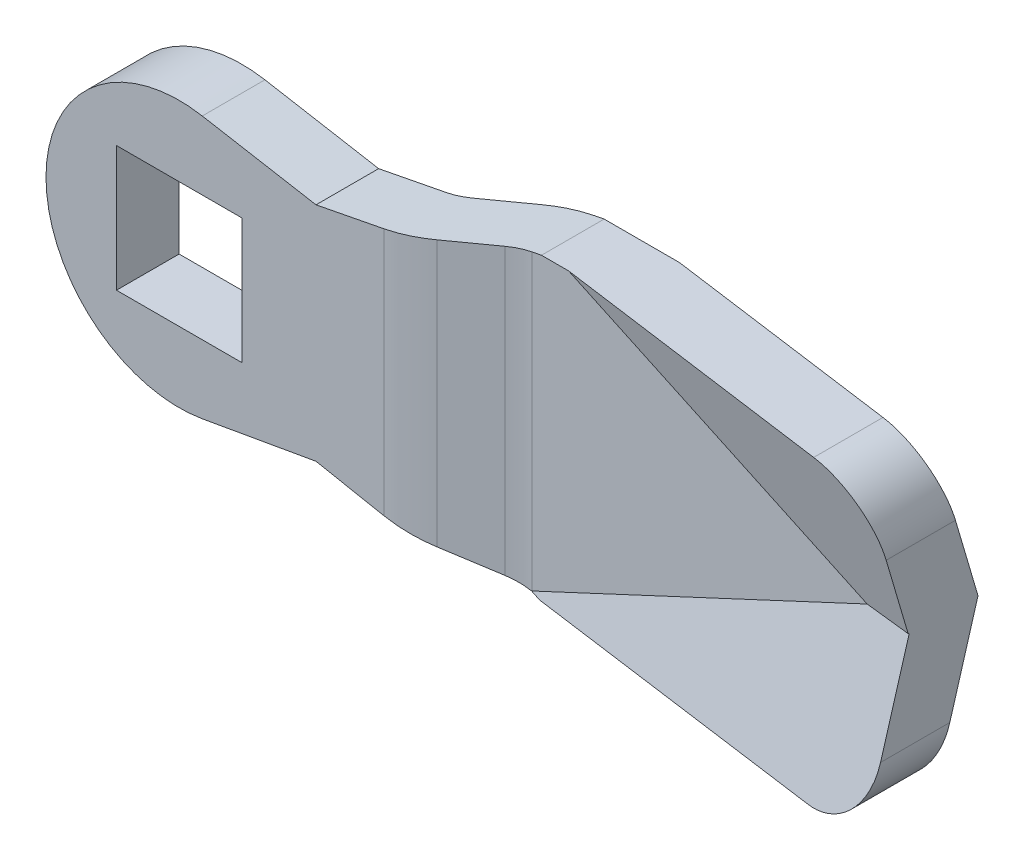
ISO-10303-21;
HEADER;
FILE_DESCRIPTION(('STEP AP214'),'2;1');
FILE_NAME('part.step','',(''),(''),'','','');
FILE_SCHEMA(('AUTOMOTIVE_DESIGN { 1 0 10303 214 1 1 1 1 }'));
ENDSEC;
DATA;
#1=APPLICATION_CONTEXT('core data for automotive mechanical design processes');
#2=APPLICATION_PROTOCOL_DEFINITION('international standard','automotive_design',2000,#1);
#3=PRODUCT_CONTEXT('',#1,'mechanical');
#4=PRODUCT('Part','Part','',(#3));
#5=PRODUCT_RELATED_PRODUCT_CATEGORY('part','',(#4));
#6=PRODUCT_DEFINITION_FORMATION('','',#4);
#7=PRODUCT_DEFINITION_CONTEXT('part definition',#1,'design');
#8=PRODUCT_DEFINITION('design','',#6,#7);
#9=PRODUCT_DEFINITION_SHAPE('','',#8);
#10=(LENGTH_UNIT() NAMED_UNIT(*) SI_UNIT(.MILLI.,.METRE.));
#11=(NAMED_UNIT(*) PLANE_ANGLE_UNIT() SI_UNIT($,.RADIAN.));
#12=(NAMED_UNIT(*) SI_UNIT($,.STERADIAN.) SOLID_ANGLE_UNIT());
#13=UNCERTAINTY_MEASURE_WITH_UNIT(LENGTH_MEASURE(1.E-05),#10,'distance_accuracy_value','');
#14=(GEOMETRIC_REPRESENTATION_CONTEXT(3) GLOBAL_UNCERTAINTY_ASSIGNED_CONTEXT((#13)) GLOBAL_UNIT_ASSIGNED_CONTEXT((#10,
#11,#12)) REPRESENTATION_CONTEXT('',''));
#15=CARTESIAN_POINT('',(0.,0.,0.));
#16=DIRECTION('',(0.,0.,1.));
#17=DIRECTION('',(1.,0.,0.));
#18=AXIS2_PLACEMENT_3D('',#15,#16,#17);
#19=CARTESIAN_POINT('',(45.,30.,38.));
#20=DIRECTION('',(1.,0.,0.));
#21=DIRECTION('',(0.,-1.,0.));
#22=AXIS2_PLACEMENT_3D('',#19,#20,#21);
#23=PLANE('',#22);
#24=DIRECTION('',(0.,0.,1.));
#25=VECTOR('',#24,1.);
#26=CARTESIAN_POINT('',(45.,5.5,38.));
#27=LINE('',#26,#25);
#28=CARTESIAN_POINT('',(45.,5.5,-0.560637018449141));
#29=VERTEX_POINT('',#28);
#30=CARTESIAN_POINT('',(45.,5.5,3.8616542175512));
#31=VERTEX_POINT('',#30);
#32=EDGE_CURVE('E236',#29,#31,#27,.T.);
#33=ORIENTED_EDGE('',*,*,#32,.T.);
#34=DIRECTION('',(0.,-0.959272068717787,-0.282483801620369));
#35=VECTOR('',#34,1.);
#36=CARTESIAN_POINT('',(45.,37.2957397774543,13.2247762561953));
#37=LINE('',#36,#35);
#38=CARTESIAN_POINT('',(45.,0.743954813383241,2.46110710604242));
#39=VERTEX_POINT('',#38);
#40=EDGE_CURVE('E222',#31,#39,#37,.T.);
#41=ORIENTED_EDGE('',*,*,#40,.T.);
#42=DIRECTION('',(0.,0.28233036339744,0.959317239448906));
#43=VECTOR('',#42,1.);
#44=CARTESIAN_POINT('',(45.,12.7014764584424,43.091014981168));
#45=LINE('',#44,#43);
#46=CARTESIAN_POINT('',(45.,0.722929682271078,2.38966678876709));
#47=VERTEX_POINT('',#46);
#48=EDGE_CURVE('E22',#47,#39,#45,.T.);
#49=ORIENTED_EDGE('',*,*,#48,.F.);
#50=DIRECTION('',(0.,-0.959272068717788,0.282483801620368));
#51=VECTOR('',#50,1.);
#52=CARTESIAN_POINT('',(45.,18.0141286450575,-2.7021979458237));
#53=LINE('',#52,#51);
#54=CARTESIAN_POINT('',(45.,-5.5,4.22217801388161));
#55=VERTEX_POINT('',#54);
#56=EDGE_CURVE('E612',#47,#55,#53,.T.);
#57=ORIENTED_EDGE('',*,*,#56,.T.);
#58=DIRECTION('',(0.,0.,1.));
#59=VECTOR('',#58,1.);
#60=CARTESIAN_POINT('',(45.,-5.5,38.));
#61=LINE('',#60,#59);
#62=CARTESIAN_POINT('',(45.,-5.5,-0.200113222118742));
#63=VERTEX_POINT('',#62);
#64=EDGE_CURVE('E249',#55,#63,#61,.F.);
#65=ORIENTED_EDGE('',*,*,#64,.T.);
#66=DIRECTION('',(0.,0.959272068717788,-0.282483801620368));
#67=VECTOR('',#66,1.);
#68=CARTESIAN_POINT('',(45.,-65.6919628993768,17.5250505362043));
#69=LINE('',#68,#67);
#70=CARTESIAN_POINT('',(45.,0.612142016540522,-2.));
#71=VERTEX_POINT('',#70);
#72=EDGE_CURVE('E373',#63,#71,#69,.T.);
#73=ORIENTED_EDGE('',*,*,#72,.T.);
#74=DIRECTION('',(0.,0.959272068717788,0.28248380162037));
#75=VECTOR('',#74,1.);
#76=CARTESIAN_POINT('',(45.,48.8419656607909,12.2025858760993));
#77=LINE('',#76,#75);
#78=EDGE_CURVE('E379',#71,#29,#77,.T.);
#79=ORIENTED_EDGE('',*,*,#78,.T.);
#80=EDGE_LOOP('',(#33,#41,#49,#57,#65,#73,#79));
#81=FACE_BOUND('',#80,.T.);
#82=ADVANCED_FACE('F14',(#81),#23,.T.);
#83=CARTESIAN_POINT('',(41.,5.5,38.));
#84=DIRECTION('',(0.,0.,-1.));
#85=DIRECTION('',(0.,-1.,0.));
#86=AXIS2_PLACEMENT_3D('',#83,#84,#85);
#87=CYLINDRICAL_SURFACE('',#86,4.);
#88=CARTESIAN_POINT('',(41.,5.5,3.31238622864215));
#89=DIRECTION('',(0.130596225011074,0.280064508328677,-0.951056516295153));
#90=DIRECTION('',(-0.401933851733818,-0.861949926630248,-0.309016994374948));
#91=AXIS2_PLACEMENT_3D('',#88,#89,#90);
#92=ELLIPSE('',#91,4.20584889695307,4.);
#93=CARTESIAN_POINT('',(41.,9.5,4.49029523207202));
#94=VERTEX_POINT('',#93);
#95=EDGE_CURVE('E245',#31,#94,#92,.F.);
#96=ORIENTED_EDGE('',*,*,#95,.F.);
#97=ORIENTED_EDGE('',*,*,#32,.F.);
#98=CARTESIAN_POINT('',(41.,5.5,-1.1099050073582));
#99=DIRECTION('',(-0.130596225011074,-0.280064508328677,0.951056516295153));
#100=DIRECTION('',(-0.401933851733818,-0.861949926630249,-0.309016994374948));
#101=AXIS2_PLACEMENT_3D('',#98,#99,#100);
#102=ELLIPSE('',#101,4.20584889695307,4.);
#103=CARTESIAN_POINT('',(41.,9.5,0.0680039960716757));
#104=VERTEX_POINT('',#103);
#105=EDGE_CURVE('E240',#104,#29,#102,.F.);
#106=ORIENTED_EDGE('',*,*,#105,.F.);
#107=DIRECTION('',(0.,0.,1.));
#108=VECTOR('',#107,1.);
#109=CARTESIAN_POINT('',(41.,9.5,38.));
#110=LINE('',#109,#108);
#111=EDGE_CURVE('E241',#94,#104,#110,.F.);
#112=ORIENTED_EDGE('',*,*,#111,.F.);
#113=EDGE_LOOP('',(#96,#97,#106,#112));
#114=FACE_BOUND('',#113,.T.);
#115=ADVANCED_FACE('F306',(#114),#87,.T.);
#116=CARTESIAN_POINT('',(41.5329093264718,1.45233554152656,4.85316954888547));
#117=DIRECTION('',(0.0012142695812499,0.959316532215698,-0.282330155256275));
#118=DIRECTION('',(0.,-0.28233036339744,-0.959317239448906));
#119=AXIS2_PLACEMENT_3D('',#116,#117,#118);
#120=PLANE('',#119);
#121=DIRECTION('',(0.988057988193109,0.0423498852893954,0.148148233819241));
#122=VECTOR('',#121,1.);
#123=CARTESIAN_POINT('',(41.9950123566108,0.615155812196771,2.01054285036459));
#124=LINE('',#123,#122);
#125=CARTESIAN_POINT('',(41.9246980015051,0.612142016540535,2.));
#126=VERTEX_POINT('',#125);
#127=EDGE_CURVE('E9',#126,#39,#124,.T.);
#128=ORIENTED_EDGE('',*,*,#127,.F.);
#129=DIRECTION('',(0.991434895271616,0.0357164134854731,0.125623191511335));
#130=VECTOR('',#129,1.);
#131=CARTESIAN_POINT('',(41.9246980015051,0.612142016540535,2.));
#132=LINE('',#131,#130);
#133=EDGE_CURVE('E237',#126,#47,#132,.T.);
#134=ORIENTED_EDGE('',*,*,#133,.T.);
#135=ORIENTED_EDGE('',*,*,#48,.T.);
#136=EDGE_LOOP('',(#128,#134,#135));
#137=FACE_BOUND('',#136,.T.);
#138=ADVANCED_FACE('F239',(#137),#120,.F.);
#139=CARTESIAN_POINT('',(41.,-5.5,6.));
#140=DIRECTION('',(0.,0.,1.));
#141=DIRECTION('',(0.,1.,0.));
#142=AXIS2_PLACEMENT_3D('',#139,#140,#141);
#143=CYLINDRICAL_SURFACE('',#142,4.);
#144=ORIENTED_EDGE('',*,*,#64,.F.);
#145=CARTESIAN_POINT('',(41.,-5.5,3.67291002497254));
#146=DIRECTION('',(0.130596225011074,-0.280064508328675,-0.951056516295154));
#147=DIRECTION('',(0.401933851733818,-0.861949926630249,0.309016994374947));
#148=AXIS2_PLACEMENT_3D('',#145,#146,#147);
#149=ELLIPSE('',#148,4.20584889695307,4.);
#150=CARTESIAN_POINT('',(41.,-9.5,4.85081902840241));
#151=VERTEX_POINT('',#150);
#152=EDGE_CURVE('E252',#151,#55,#149,.F.);
#153=ORIENTED_EDGE('',*,*,#152,.F.);
#154=DIRECTION('',(0.,0.,1.));
#155=VECTOR('',#154,1.);
#156=CARTESIAN_POINT('',(41.,-9.5,6.));
#157=LINE('',#156,#155);
#158=CARTESIAN_POINT('',(41.,-9.5,0.428527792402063));
#159=VERTEX_POINT('',#158);
#160=EDGE_CURVE('E254',#159,#151,#157,.T.);
#161=ORIENTED_EDGE('',*,*,#160,.F.);
#162=CARTESIAN_POINT('',(41.,-5.5,-0.749381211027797));
#163=DIRECTION('',(-0.130596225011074,0.280064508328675,0.951056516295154));
#164=DIRECTION('',(0.401933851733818,-0.861949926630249,0.309016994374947));
#165=AXIS2_PLACEMENT_3D('',#162,#163,#164);
#166=ELLIPSE('',#165,4.20584889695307,4.);
#167=EDGE_CURVE('E247',#63,#159,#166,.F.);
#168=ORIENTED_EDGE('',*,*,#167,.F.);
#169=EDGE_LOOP('',(#144,#153,#161,#168));
#170=FACE_BOUND('',#169,.T.);
#171=ADVANCED_FACE('F385',(#170),#143,.T.);
#172=CARTESIAN_POINT('',(6.5,2.8,-2.4));
#173=DIRECTION('',(0.,-1.,0.));
#174=DIRECTION('',(-1.,0.,0.));
#175=AXIS2_PLACEMENT_3D('',#172,#173,#174);
#176=PLANE('',#175);
#177=DIRECTION('',(0.707106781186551,0.,0.707106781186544));
#178=VECTOR('',#177,1.);
#179=CARTESIAN_POINT('',(7.5,2.8,-3.4));
#180=LINE('',#179,#178);
#181=CARTESIAN_POINT('',(8.5,2.8,-2.4));
#182=VERTEX_POINT('',#181);
#183=CARTESIAN_POINT('',(10.5,2.8,-0.400000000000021));
#184=VERTEX_POINT('',#183);
#185=EDGE_CURVE('E605',#182,#184,#180,.T.);
#186=ORIENTED_EDGE('',*,*,#185,.F.);
#187=DIRECTION('',(1.,0.,0.));
#188=VECTOR('',#187,1.);
#189=CARTESIAN_POINT('',(6.5,2.8,-2.4));
#190=LINE('',#189,#188);
#191=CARTESIAN_POINT('',(6.5,2.8,-2.4));
#192=VERTEX_POINT('',#191);
#193=EDGE_CURVE('E589',#192,#182,#190,.T.);
#194=ORIENTED_EDGE('',*,*,#193,.F.);
#195=DIRECTION('',(0.,0.,1.));
#196=VECTOR('',#195,1.);
#197=CARTESIAN_POINT('',(6.5,2.8,-2.4));
#198=LINE('',#197,#196);
#199=CARTESIAN_POINT('',(6.5,2.8,0.));
#200=VERTEX_POINT('',#199);
#201=EDGE_CURVE('E580',#192,#200,#198,.T.);
#202=ORIENTED_EDGE('',*,*,#201,.T.);
#203=DIRECTION('',(1.,0.,0.));
#204=VECTOR('',#203,1.);
#205=CARTESIAN_POINT('',(6.5,2.8,0.));
#206=LINE('',#205,#204);
#207=CARTESIAN_POINT('',(10.5,2.8,0.));
#208=VERTEX_POINT('',#207);
#209=EDGE_CURVE('E37',#200,#208,#206,.T.);
#210=ORIENTED_EDGE('',*,*,#209,.T.);
#211=DIRECTION('',(0.,0.,1.));
#212=VECTOR('',#211,1.);
#213=CARTESIAN_POINT('',(10.5,2.8,-2.4));
#214=LINE('',#213,#212);
#215=EDGE_CURVE('E582',#184,#208,#214,.T.);
#216=ORIENTED_EDGE('',*,*,#215,.F.);
#217=EDGE_LOOP('',(#186,#194,#202,#210,#216));
#218=FACE_BOUND('',#217,.T.);
#219=ADVANCED_FACE('F648',(#218),#176,.F.);
#220=CARTESIAN_POINT('',(10.5,-2.8,-2.4));
#221=DIRECTION('',(1.,0.,0.));
#222=DIRECTION('',(0.,-1.,0.));
#223=AXIS2_PLACEMENT_3D('',#220,#221,#222);
#224=PLANE('',#223);
#225=DIRECTION('',(0.,0.,1.));
#226=VECTOR('',#225,1.);
#227=CARTESIAN_POINT('',(10.5,-2.8,-2.4));
#228=LINE('',#227,#226);
#229=CARTESIAN_POINT('',(10.5,-2.8,-0.400000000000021));
#230=VERTEX_POINT('',#229);
#231=CARTESIAN_POINT('',(10.5,-2.8,0.));
#232=VERTEX_POINT('',#231);
#233=EDGE_CURVE('E584',#230,#232,#228,.T.);
#234=ORIENTED_EDGE('',*,*,#233,.F.);
#235=DIRECTION('',(0.,-1.,0.));
#236=VECTOR('',#235,1.);
#237=CARTESIAN_POINT('',(10.5,9.5,-0.400000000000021));
#238=LINE('',#237,#236);
#239=EDGE_CURVE('E609',#184,#230,#238,.T.);
#240=ORIENTED_EDGE('',*,*,#239,.F.);
#241=ORIENTED_EDGE('',*,*,#215,.T.);
#242=DIRECTION('',(0.,1.,0.));
#243=VECTOR('',#242,1.);
#244=CARTESIAN_POINT('',(10.5,-2.8,0.));
#245=LINE('',#244,#243);
#246=EDGE_CURVE('E598',#232,#208,#245,.T.);
#247=ORIENTED_EDGE('',*,*,#246,.F.);
#248=EDGE_LOOP('',(#234,#240,#241,#247));
#249=FACE_BOUND('',#248,.T.);
#250=ADVANCED_FACE('F654',(#249),#224,.T.);
#251=CARTESIAN_POINT('',(10.5,-2.8,-2.4));
#252=DIRECTION('',(0.,1.,0.));
#253=DIRECTION('',(1.,0.,0.));
#254=AXIS2_PLACEMENT_3D('',#251,#252,#253);
#255=PLANE('',#254);
#256=DIRECTION('',(0.707106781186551,0.,0.707106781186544));
#257=VECTOR('',#256,1.);
#258=CARTESIAN_POINT('',(8.5,-2.8,-2.4));
#259=LINE('',#258,#257);
#260=CARTESIAN_POINT('',(8.5,-2.8,-2.4));
#261=VERTEX_POINT('',#260);
#262=EDGE_CURVE('E29',#261,#230,#259,.T.);
#263=ORIENTED_EDGE('',*,*,#262,.T.);
#264=ORIENTED_EDGE('',*,*,#233,.T.);
#265=DIRECTION('',(-1.,0.,0.));
#266=VECTOR('',#265,1.);
#267=CARTESIAN_POINT('',(10.5,-2.8,0.));
#268=LINE('',#267,#266);
#269=CARTESIAN_POINT('',(6.5,-2.8,0.));
#270=VERTEX_POINT('',#269);
#271=EDGE_CURVE('E600',#232,#270,#268,.T.);
#272=ORIENTED_EDGE('',*,*,#271,.T.);
#273=DIRECTION('',(0.,0.,1.));
#274=VECTOR('',#273,1.);
#275=CARTESIAN_POINT('',(6.5,-2.8,-2.4));
#276=LINE('',#275,#274);
#277=CARTESIAN_POINT('',(6.5,-2.8,-2.4));
#278=VERTEX_POINT('',#277);
#279=EDGE_CURVE('E586',#278,#270,#276,.T.);
#280=ORIENTED_EDGE('',*,*,#279,.F.);
#281=DIRECTION('',(-1.,0.,0.));
#282=VECTOR('',#281,1.);
#283=CARTESIAN_POINT('',(10.5,-2.8,-2.4));
#284=LINE('',#283,#282);
#285=EDGE_CURVE('E592',#261,#278,#284,.T.);
#286=ORIENTED_EDGE('',*,*,#285,.F.);
#287=EDGE_LOOP('',(#263,#264,#272,#280,#286));
#288=FACE_BOUND('',#287,.T.);
#289=ADVANCED_FACE('F658',(#288),#255,.F.);
#290=CARTESIAN_POINT('',(6.5,-2.8,-2.4));
#291=DIRECTION('',(0.,0.,-1.));
#292=DIRECTION('',(0.,-1.,0.));
#293=AXIS2_PLACEMENT_3D('',#290,#291,#292);
#294=PLANE('',#293);
#295=ORIENTED_EDGE('',*,*,#193,.T.);
#296=DIRECTION('',(0.,-1.,0.));
#297=VECTOR('',#296,1.);
#298=CARTESIAN_POINT('',(8.5,9.5,-2.4));
#299=LINE('',#298,#297);
#300=EDGE_CURVE('E607',#182,#261,#299,.T.);
#301=ORIENTED_EDGE('',*,*,#300,.T.);
#302=ORIENTED_EDGE('',*,*,#285,.T.);
#303=DIRECTION('',(0.,-1.,0.));
#304=VECTOR('',#303,1.);
#305=CARTESIAN_POINT('',(6.5,2.8,-2.4));
#306=LINE('',#305,#304);
#307=EDGE_CURVE('E594',#192,#278,#306,.T.);
#308=ORIENTED_EDGE('',*,*,#307,.F.);
#309=EDGE_LOOP('',(#295,#301,#302,#308));
#310=FACE_BOUND('',#309,.T.);
#311=ADVANCED_FACE('F346',(#310),#294,.T.);
#312=CARTESIAN_POINT('',(0.,-9.5,4.));
#313=DIRECTION('',(0.,0.,-1.));
#314=DIRECTION('',(0.,-1.,0.));
#315=AXIS2_PLACEMENT_3D('',#312,#313,#314);
#316=PLANE('',#315);
#317=DIRECTION('',(0.,-1.,0.));
#318=VECTOR('',#317,1.);
#319=CARTESIAN_POINT('',(-4.,-9.5,4.));
#320=LINE('',#319,#318);
#321=CARTESIAN_POINT('',(-4.,4.,4.));
#322=VERTEX_POINT('',#321);
#323=CARTESIAN_POINT('',(-4.,-4.,4.));
#324=VERTEX_POINT('',#323);
#325=EDGE_CURVE('E380',#322,#324,#320,.T.);
#326=ORIENTED_EDGE('',*,*,#325,.F.);
#327=DIRECTION('',(1.,0.,0.));
#328=VECTOR('',#327,1.);
#329=CARTESIAN_POINT('',(0.,4.,4.));
#330=LINE('',#329,#328);
#331=CARTESIAN_POINT('',(4.,4.,4.));
#332=VERTEX_POINT('',#331);
#333=EDGE_CURVE('E502',#322,#332,#330,.T.);
#334=ORIENTED_EDGE('',*,*,#333,.T.);
#335=DIRECTION('',(0.,1.,0.));
#336=VECTOR('',#335,1.);
#337=CARTESIAN_POINT('',(4.,-9.5,4.));
#338=LINE('',#337,#336);
#339=CARTESIAN_POINT('',(4.,-4.,4.));
#340=VERTEX_POINT('',#339);
#341=EDGE_CURVE('E505',#340,#332,#338,.T.);
#342=ORIENTED_EDGE('',*,*,#341,.F.);
#343=DIRECTION('',(-1.,0.,0.));
#344=VECTOR('',#343,1.);
#345=CARTESIAN_POINT('',(0.,-4.,4.));
#346=LINE('',#345,#344);
#347=EDGE_CURVE('E508',#340,#324,#346,.T.);
#348=ORIENTED_EDGE('',*,*,#347,.T.);
#349=EDGE_LOOP('',(#326,#334,#342,#348));
#350=FACE_BOUND('',#349,.T.);
#351=DIRECTION('',(0.981627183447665,0.190808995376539,0.));
#352=VECTOR('',#351,1.);
#353=CARTESIAN_POINT('',(-2.78934915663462,4.8499574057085,4.));
#354=LINE('',#353,#352);
#355=CARTESIAN_POINT('',(8.73728230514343,7.09050759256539,4.));
#356=VERTEX_POINT('',#355);
#357=CARTESIAN_POINT('',(13.0786438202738,7.934382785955,4.));
#358=VERTEX_POINT('',#357);
#359=EDGE_CURVE('E461',#356,#358,#354,.T.);
#360=ORIENTED_EDGE('',*,*,#359,.F.);
#361=DIRECTION('',(-0.984807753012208,0.17364817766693,0.));
#362=VECTOR('',#361,1.);
#363=CARTESIAN_POINT('',(3.10060519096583,8.08440584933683,4.));
#364=LINE('',#363,#362);
#365=CARTESIAN_POINT('',(1.47600951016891,8.37086590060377,4.));
#366=VERTEX_POINT('',#365);
#367=EDGE_CURVE('E476',#356,#366,#364,.T.);
#368=ORIENTED_EDGE('',*,*,#367,.T.);
#369=CARTESIAN_POINT('',(0.,0.,4.));
#370=DIRECTION('',(0.,0.,-1.));
#371=DIRECTION('',(0.,-1.,0.));
#372=AXIS2_PLACEMENT_3D('',#369,#370,#371);
#373=CIRCLE('',#372,8.5);
#374=CARTESIAN_POINT('',(1.47600951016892,-8.37086590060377,4.));
#375=VERTEX_POINT('',#374);
#376=EDGE_CURVE('E474',#375,#366,#373,.T.);
#377=ORIENTED_EDGE('',*,*,#376,.F.);
#378=DIRECTION('',(-0.984807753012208,-0.17364817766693,0.));
#379=VECTOR('',#378,1.);
#380=CARTESIAN_POINT('',(-0.148586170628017,-8.65732595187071,4.));
#381=LINE('',#380,#379);
#382=CARTESIAN_POINT('',(8.73728230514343,-7.0905075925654,4.));
#383=VERTEX_POINT('',#382);
#384=EDGE_CURVE('E479',#383,#375,#381,.T.);
#385=ORIENTED_EDGE('',*,*,#384,.F.);
#386=DIRECTION('',(0.981627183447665,-0.190808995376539,0.));
#387=VECTOR('',#386,1.);
#388=CARTESIAN_POINT('',(0.769413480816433,-5.54171078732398,4.));
#389=LINE('',#388,#387);
#390=CARTESIAN_POINT('',(13.0786438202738,-7.93438278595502,4.));
#391=VERTEX_POINT('',#390);
#392=EDGE_CURVE('E550',#383,#391,#389,.T.);
#393=ORIENTED_EDGE('',*,*,#392,.T.);
#394=DIRECTION('',(0.,1.,0.));
#395=VECTOR('',#394,1.);
#396=CARTESIAN_POINT('',(13.0786438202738,-9.5,4.));
#397=LINE('',#396,#395);
#398=EDGE_CURVE('E441',#391,#358,#397,.T.);
#399=ORIENTED_EDGE('',*,*,#398,.T.);
#400=EDGE_LOOP('',(#360,#368,#377,#385,#393,#399));
#401=FACE_BOUND('',#400,.T.);
#402=ADVANCED_FACE('F343',(#350,#401),#316,.F.);
#403=CARTESIAN_POINT('',(0.,-9.5,0.));
#404=DIRECTION('',(0.,0.,1.));
#405=DIRECTION('',(0.,1.,0.));
#406=AXIS2_PLACEMENT_3D('',#403,#404,#405);
#407=PLANE('',#406);
#408=ORIENTED_EDGE('',*,*,#209,.F.);
#409=DIRECTION('',(0.,-1.,0.));
#410=VECTOR('',#409,1.);
#411=CARTESIAN_POINT('',(6.5,2.8,0.));
#412=LINE('',#411,#410);
#413=EDGE_CURVE('E603',#200,#270,#412,.T.);
#414=ORIENTED_EDGE('',*,*,#413,.T.);
#415=ORIENTED_EDGE('',*,*,#271,.F.);
#416=ORIENTED_EDGE('',*,*,#246,.T.);
#417=EDGE_LOOP('',(#408,#414,#415,#416));
#418=FACE_BOUND('',#417,.T.);
#419=DIRECTION('',(0.,-1.,0.));
#420=VECTOR('',#419,1.);
#421=CARTESIAN_POINT('',(-4.,4.,0.));
#422=LINE('',#421,#420);
#423=CARTESIAN_POINT('',(-4.,4.,0.));
#424=VERTEX_POINT('',#423);
#425=CARTESIAN_POINT('',(-4.,-4.,0.));
#426=VERTEX_POINT('',#425);
#427=EDGE_CURVE('E481',#424,#426,#422,.T.);
#428=ORIENTED_EDGE('',*,*,#427,.T.);
#429=DIRECTION('',(-1.,0.,0.));
#430=VECTOR('',#429,1.);
#431=CARTESIAN_POINT('',(4.,-4.,0.));
#432=LINE('',#431,#430);
#433=CARTESIAN_POINT('',(4.,-4.,0.));
#434=VERTEX_POINT('',#433);
#435=EDGE_CURVE('E484',#434,#426,#432,.T.);
#436=ORIENTED_EDGE('',*,*,#435,.F.);
#437=DIRECTION('',(0.,1.,0.));
#438=VECTOR('',#437,1.);
#439=CARTESIAN_POINT('',(4.,-4.,0.));
#440=LINE('',#439,#438);
#441=CARTESIAN_POINT('',(4.,4.,0.));
#442=VERTEX_POINT('',#441);
#443=EDGE_CURVE('E487',#434,#442,#440,.T.);
#444=ORIENTED_EDGE('',*,*,#443,.T.);
#445=DIRECTION('',(1.,0.,0.));
#446=VECTOR('',#445,1.);
#447=CARTESIAN_POINT('',(-4.,4.,0.));
#448=LINE('',#447,#446);
#449=EDGE_CURVE('E490',#424,#442,#448,.T.);
#450=ORIENTED_EDGE('',*,*,#449,.F.);
#451=EDGE_LOOP('',(#428,#436,#444,#450));
#452=FACE_BOUND('',#451,.T.);
#453=DIRECTION('',(0.,1.,0.));
#454=VECTOR('',#453,1.);
#455=CARTESIAN_POINT('',(13.0786438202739,-9.5,0.));
#456=LINE('',#455,#454);
#457=CARTESIAN_POINT('',(13.0786438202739,-7.93438278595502,0.));
#458=VERTEX_POINT('',#457);
#459=CARTESIAN_POINT('',(13.0786438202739,7.93438278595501,0.));
#460=VERTEX_POINT('',#459);
#461=EDGE_CURVE('E438',#458,#460,#456,.T.);
#462=ORIENTED_EDGE('',*,*,#461,.F.);
#463=DIRECTION('',(-0.981627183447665,0.190808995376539,0.));
#464=VECTOR('',#463,1.);
#465=CARTESIAN_POINT('',(0.769413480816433,-5.54171078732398,0.));
#466=LINE('',#465,#464);
#467=CARTESIAN_POINT('',(8.73728230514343,-7.0905075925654,0.));
#468=VERTEX_POINT('',#467);
#469=EDGE_CURVE('E526',#458,#468,#466,.T.);
#470=ORIENTED_EDGE('',*,*,#469,.T.);
#471=DIRECTION('',(0.984807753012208,0.17364817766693,0.));
#472=VECTOR('',#471,1.);
#473=CARTESIAN_POINT('',(-0.148586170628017,-8.65732595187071,0.));
#474=LINE('',#473,#472);
#475=CARTESIAN_POINT('',(1.47600951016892,-8.37086590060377,0.));
#476=VERTEX_POINT('',#475);
#477=EDGE_CURVE('E257',#476,#468,#474,.T.);
#478=ORIENTED_EDGE('',*,*,#477,.F.);
#479=CARTESIAN_POINT('',(0.,0.,0.));
#480=DIRECTION('',(0.,0.,1.));
#481=DIRECTION('',(0.,1.,0.));
#482=AXIS2_PLACEMENT_3D('',#479,#480,#481);
#483=CIRCLE('',#482,8.5);
#484=CARTESIAN_POINT('',(1.47600951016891,8.37086590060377,0.));
#485=VERTEX_POINT('',#484);
#486=EDGE_CURVE('E472',#485,#476,#483,.T.);
#487=ORIENTED_EDGE('',*,*,#486,.F.);
#488=DIRECTION('',(0.984807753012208,-0.17364817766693,0.));
#489=VECTOR('',#488,1.);
#490=CARTESIAN_POINT('',(3.10060519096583,8.08440584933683,0.));
#491=LINE('',#490,#489);
#492=CARTESIAN_POINT('',(8.73728230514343,7.09050759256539,0.));
#493=VERTEX_POINT('',#492);
#494=EDGE_CURVE('E259',#485,#493,#491,.T.);
#495=ORIENTED_EDGE('',*,*,#494,.T.);
#496=DIRECTION('',(-0.981627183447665,-0.190808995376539,0.));
#497=VECTOR('',#496,1.);
#498=CARTESIAN_POINT('',(-2.78934915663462,4.8499574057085,0.));
#499=LINE('',#498,#497);
#500=EDGE_CURVE('E527',#460,#493,#499,.T.);
#501=ORIENTED_EDGE('',*,*,#500,.F.);
#502=EDGE_LOOP('',(#462,#470,#478,#487,#495,#501));
#503=FACE_BOUND('',#502,.T.);
#504=ADVANCED_FACE('F319',(#418,#452,#503),#407,.F.);
#505=CARTESIAN_POINT('',(20.5128904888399,9.5,6.));
#506=DIRECTION('',(0.,-1.,0.));
#507=DIRECTION('',(-1.,0.,0.));
#508=AXIS2_PLACEMENT_3D('',#505,#506,#507);
#509=PLANE('',#508);
#510=DIRECTION('',(0.990703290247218,0.,0.13604040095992));
#511=VECTOR('',#510,1.);
#512=CARTESIAN_POINT('',(46.8525031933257,9.5,5.29394339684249));
#513=LINE('',#512,#511);
#514=CARTESIAN_POINT('',(22.8646250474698,9.5,2.));
#515=VERTEX_POINT('',#514);
#516=EDGE_CURVE('E412',#515,#94,#513,.T.);
#517=ORIENTED_EDGE('',*,*,#516,.T.);
#518=ORIENTED_EDGE('',*,*,#111,.T.);
#519=DIRECTION('',(-0.990703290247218,0.,-0.13604040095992));
#520=VECTOR('',#519,1.);
#521=CARTESIAN_POINT('',(68.6351335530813,9.5,3.86277755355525));
#522=LINE('',#521,#520);
#523=CARTESIAN_POINT('',(25.9399270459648,9.5,-2.));
#524=VERTEX_POINT('',#523);
#525=EDGE_CURVE('E401',#104,#524,#522,.T.);
#526=ORIENTED_EDGE('',*,*,#525,.T.);
#527=DIRECTION('',(-1.,0.,0.));
#528=VECTOR('',#527,1.);
#529=CARTESIAN_POINT('',(45.,9.5,-2.));
#530=LINE('',#529,#528);
#531=CARTESIAN_POINT('',(21.1330461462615,9.5,-2.));
#532=VERTEX_POINT('',#531);
#533=EDGE_CURVE('E395',#524,#532,#530,.T.);
#534=ORIENTED_EDGE('',*,*,#533,.T.);
#535=DIRECTION('',(0.,0.,-1.));
#536=VECTOR('',#535,1.);
#537=CARTESIAN_POINT('',(21.1330461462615,9.5,6.));
#538=LINE('',#537,#536);
#539=CARTESIAN_POINT('',(21.1330461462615,9.5,2.));
#540=VERTEX_POINT('',#539);
#541=EDGE_CURVE('E470',#540,#532,#538,.T.);
#542=ORIENTED_EDGE('',*,*,#541,.F.);
#543=DIRECTION('',(-1.,0.,0.));
#544=VECTOR('',#543,1.);
#545=CARTESIAN_POINT('',(45.,9.5,2.));
#546=LINE('',#545,#544);
#547=EDGE_CURVE('E423',#515,#540,#546,.T.);
#548=ORIENTED_EDGE('',*,*,#547,.F.);
#549=EDGE_LOOP('',(#517,#518,#526,#534,#542,#548));
#550=FACE_BOUND('',#549,.T.);
#551=ADVANCED_FACE('F315',(#550),#509,.F.);
#552=CARTESIAN_POINT('',(20.5128904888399,-9.5,6.));
#553=DIRECTION('',(0.,1.,0.));
#554=DIRECTION('',(1.,0.,0.));
#555=AXIS2_PLACEMENT_3D('',#552,#553,#554);
#556=CYLINDRICAL_SURFACE('',#555,4.);
#557=DIRECTION('',(0.,1.,0.));
#558=VECTOR('',#557,1.);
#559=CARTESIAN_POINT('',(20.5128904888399,-9.5,2.));
#560=LINE('',#559,#558);
#561=CARTESIAN_POINT('',(20.5128904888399,-9.3723478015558,2.));
#562=VERTEX_POINT('',#561);
#563=CARTESIAN_POINT('',(20.5128904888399,9.37945395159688,2.));
#564=VERTEX_POINT('',#563);
#565=EDGE_CURVE('E404',#562,#564,#560,.T.);
#566=ORIENTED_EDGE('',*,*,#565,.T.);
#567=CARTESIAN_POINT('',(20.5128904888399,9.37945395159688,6.));
#568=DIRECTION('',(-0.190808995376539,0.981627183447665,0.));
#569=DIRECTION('',(0.981627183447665,0.190808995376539,0.));
#570=AXIS2_PLACEMENT_3D('',#567,#568,#569);
#571=ELLIPSE('',#570,4.07486677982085,4.);
#572=CARTESIAN_POINT('',(19.0794186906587,9.10081526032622,2.26567829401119));
#573=VERTEX_POINT('',#572);
#574=EDGE_CURVE('E457',#564,#573,#571,.T.);
#575=ORIENTED_EDGE('',*,*,#574,.T.);
#576=DIRECTION('',(0.,1.,0.));
#577=VECTOR('',#576,1.);
#578=CARTESIAN_POINT('',(19.0794186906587,-9.5,2.26567829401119));
#579=LINE('',#578,#577);
#580=CARTESIAN_POINT('',(19.0794186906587,-9.10081526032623,2.26567829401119));
#581=VERTEX_POINT('',#580);
#582=EDGE_CURVE('E428',#581,#573,#579,.T.);
#583=ORIENTED_EDGE('',*,*,#582,.F.);
#584=CARTESIAN_POINT('',(20.5128904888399,-9.37945395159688,6.));
#585=DIRECTION('',(0.190808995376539,0.981627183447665,0.));
#586=DIRECTION('',(-0.981627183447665,0.190808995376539,0.));
#587=AXIS2_PLACEMENT_3D('',#584,#585,#586);
#588=ELLIPSE('',#587,4.07486677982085,4.);
#589=CARTESIAN_POINT('',(20.5021269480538,-9.37736173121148,2.00001448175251));
#590=VERTEX_POINT('',#589);
#591=EDGE_CURVE('E456',#590,#581,#588,.T.);
#592=ORIENTED_EDGE('',*,*,#591,.F.);
#593=CARTESIAN_POINT('',(20.5128904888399,-7.93831092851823,6.));
#594=DIRECTION('',(-0.401933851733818,0.861949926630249,-0.309016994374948));
#595=DIRECTION('',(0.683336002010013,0.506993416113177,0.52536614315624));
#596=AXIS2_PLACEMENT_3D('',#593,#594,#595);
#597=ELLIPSE('',#596,4.64064080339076,4.);
#598=EDGE_CURVE('E419',#590,#562,#597,.F.);
#599=ORIENTED_EDGE('',*,*,#598,.T.);
#600=EDGE_LOOP('',(#566,#575,#583,#592,#599));
#601=FACE_BOUND('',#600,.T.);
#602=ADVANCED_FACE('F318',(#601),#556,.F.);
#603=CARTESIAN_POINT('',(45.,-9.5,-2.));
#604=DIRECTION('',(0.,0.,-1.));
#605=DIRECTION('',(0.,-1.,0.));
#606=AXIS2_PLACEMENT_3D('',#603,#604,#605);
#607=PLANE('',#606);
#608=DIRECTION('',(0.,1.,0.));
#609=VECTOR('',#608,1.);
#610=CARTESIAN_POINT('',(20.5128904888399,-9.5,-2.));
#611=LINE('',#610,#609);
#612=CARTESIAN_POINT('',(20.5128904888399,-9.37945395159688,-2.));
#613=VERTEX_POINT('',#612);
#614=CARTESIAN_POINT('',(20.5128904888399,9.37945395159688,-2.));
#615=VERTEX_POINT('',#614);
#616=EDGE_CURVE('E424',#613,#615,#611,.T.);
#617=ORIENTED_EDGE('',*,*,#616,.T.);
#618=DIRECTION('',(0.981627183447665,0.190808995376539,0.));
#619=VECTOR('',#618,1.);
#620=CARTESIAN_POINT('',(8.73728230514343,7.09050759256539,-2.));
#621=LINE('',#620,#619);
#622=EDGE_CURVE('E577',#615,#532,#621,.T.);
#623=ORIENTED_EDGE('',*,*,#622,.T.);
#624=ORIENTED_EDGE('',*,*,#533,.F.);
#625=DIRECTION('',(-0.906307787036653,0.422618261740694,0.));
#626=VECTOR('',#625,1.);
#627=CARTESIAN_POINT('',(45.,0.612142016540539,-2.));
#628=LINE('',#627,#626);
#629=EDGE_CURVE('E416',#71,#524,#628,.T.);
#630=ORIENTED_EDGE('',*,*,#629,.F.);
#631=DIRECTION('',(-0.906307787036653,-0.422618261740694,0.));
#632=VECTOR('',#631,1.);
#633=CARTESIAN_POINT('',(45.,0.612142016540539,-2.));
#634=LINE('',#633,#632);
#635=CARTESIAN_POINT('',(23.3144414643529,-9.5,-2.));
#636=VERTEX_POINT('',#635);
#637=EDGE_CURVE('E377',#71,#636,#634,.T.);
#638=ORIENTED_EDGE('',*,*,#637,.T.);
#639=DIRECTION('',(-1.,0.,0.));
#640=VECTOR('',#639,1.);
#641=CARTESIAN_POINT('',(45.,-9.5,-2.));
#642=LINE('',#641,#640);
#643=CARTESIAN_POINT('',(21.1330461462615,-9.5,-2.));
#644=VERTEX_POINT('',#643);
#645=EDGE_CURVE('E421',#636,#644,#642,.T.);
#646=ORIENTED_EDGE('',*,*,#645,.T.);
#647=DIRECTION('',(0.981627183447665,-0.190808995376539,0.));
#648=VECTOR('',#647,1.);
#649=CARTESIAN_POINT('',(8.73728230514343,-7.0905075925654,-2.));
#650=LINE('',#649,#648);
#651=EDGE_CURVE('E575',#613,#644,#650,.T.);
#652=ORIENTED_EDGE('',*,*,#651,.F.);
#653=EDGE_LOOP('',(#617,#623,#624,#630,#638,#646,#652));
#654=FACE_BOUND('',#653,.T.);
#655=ADVANCED_FACE('F324',(#654),#607,.T.);
#656=CARTESIAN_POINT('',(45.,-9.5,2.));
#657=DIRECTION('',(0.,0.,-1.));
#658=DIRECTION('',(0.,-1.,0.));
#659=AXIS2_PLACEMENT_3D('',#656,#657,#658);
#660=PLANE('',#659);
#661=DIRECTION('',(0.981627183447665,0.190808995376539,0.));
#662=VECTOR('',#661,1.);
#663=CARTESIAN_POINT('',(40.5722875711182,13.2786057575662,2.));
#664=LINE('',#663,#662);
#665=EDGE_CURVE('E463',#564,#540,#664,.T.);
#666=ORIENTED_EDGE('',*,*,#665,.F.);
#667=ORIENTED_EDGE('',*,*,#565,.F.);
#668=DIRECTION('',(0.906307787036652,0.422618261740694,0.));
#669=VECTOR('',#668,1.);
#670=CARTESIAN_POINT('',(40.5775569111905,-0.0160401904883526,2.));
#671=LINE('',#670,#669);
#672=EDGE_CURVE('E394',#126,#562,#671,.F.);
#673=ORIENTED_EDGE('',*,*,#672,.F.);
#674=DIRECTION('',(-0.906307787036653,0.422618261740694,0.));
#675=VECTOR('',#674,1.);
#676=CARTESIAN_POINT('',(48.3239071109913,-2.37185819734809,2.));
#677=LINE('',#676,#675);
#678=EDGE_CURVE('E225',#126,#515,#677,.T.);
#679=ORIENTED_EDGE('',*,*,#678,.T.);
#680=ORIENTED_EDGE('',*,*,#547,.T.);
#681=EDGE_LOOP('',(#666,#667,#673,#679,#680));
#682=FACE_BOUND('',#681,.T.);
#683=ADVANCED_FACE('F327',(#682),#660,.F.);
#684=CARTESIAN_POINT('',(15.9455874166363,-9.5,3.46864341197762));
#685=DIRECTION('',(0.358367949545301,0.,0.933580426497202));
#686=DIRECTION('',(-0.933580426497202,0.,0.358367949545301));
#687=AXIS2_PLACEMENT_3D('',#684,#685,#686);
#688=PLANE('',#687);
#689=ORIENTED_EDGE('',*,*,#582,.T.);
#690=DIRECTION('',(-0.918577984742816,-0.178553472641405,0.352609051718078));
#691=VECTOR('',#690,1.);
#692=CARTESIAN_POINT('',(12.9946800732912,7.91806188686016,4.60139061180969));
#693=LINE('',#692,#691);
#694=CARTESIAN_POINT('',(15.9455874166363,8.49166016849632,3.46864341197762));
#695=VERTEX_POINT('',#694);
#696=EDGE_CURVE('E451',#573,#695,#693,.T.);
#697=ORIENTED_EDGE('',*,*,#696,.T.);
#698=DIRECTION('',(0.,1.,0.));
#699=VECTOR('',#698,1.);
#700=CARTESIAN_POINT('',(15.9455874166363,-9.5,3.46864341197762));
#701=LINE('',#700,#699);
#702=CARTESIAN_POINT('',(15.9455874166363,-8.49166016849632,3.46864341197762));
#703=VERTEX_POINT('',#702);
#704=EDGE_CURVE('E444',#703,#695,#701,.T.);
#705=ORIENTED_EDGE('',*,*,#704,.F.);
#706=DIRECTION('',(-0.918577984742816,0.178553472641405,0.352609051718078));
#707=VECTOR('',#706,1.);
#708=CARTESIAN_POINT('',(16.1109705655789,-8.52380739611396,3.40515876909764));
#709=LINE('',#708,#707);
#710=EDGE_CURVE('E452',#581,#703,#709,.T.);
#711=ORIENTED_EDGE('',*,*,#710,.F.);
#712=EDGE_LOOP('',(#689,#697,#705,#711));
#713=FACE_BOUND('',#712,.T.);
#714=ADVANCED_FACE('F350',(#713),#688,.T.);
#715=CARTESIAN_POINT('',(13.0786438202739,-9.5,-4.));
#716=DIRECTION('',(0.,1.,0.));
#717=DIRECTION('',(1.,0.,0.));
#718=AXIS2_PLACEMENT_3D('',#715,#716,#717);
#719=CYLINDRICAL_SURFACE('',#718,8.);
#720=ORIENTED_EDGE('',*,*,#704,.T.);
#721=CARTESIAN_POINT('',(13.0786438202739,7.93438278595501,-4.));
#722=DIRECTION('',(-0.190808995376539,0.981627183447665,0.));
#723=DIRECTION('',(0.981627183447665,0.190808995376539,0.));
#724=AXIS2_PLACEMENT_3D('',#721,#722,#723);
#725=ELLIPSE('',#724,8.14973355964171,8.);
#726=EDGE_CURVE('E465',#695,#358,#725,.F.);
#727=ORIENTED_EDGE('',*,*,#726,.T.);
#728=ORIENTED_EDGE('',*,*,#398,.F.);
#729=CARTESIAN_POINT('',(13.0786438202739,-7.93438278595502,-4.));
#730=DIRECTION('',(0.190808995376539,0.981627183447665,0.));
#731=DIRECTION('',(-0.981627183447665,0.190808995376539,0.));
#732=AXIS2_PLACEMENT_3D('',#729,#730,#731);
#733=ELLIPSE('',#732,8.14973355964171,8.);
#734=EDGE_CURVE('E554',#703,#391,#733,.F.);
#735=ORIENTED_EDGE('',*,*,#734,.F.);
#736=EDGE_LOOP('',(#720,#727,#728,#735));
#737=FACE_BOUND('',#736,.T.);
#738=ADVANCED_FACE('F339',(#737),#719,.T.);
#739=CARTESIAN_POINT('',(13.0786438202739,-9.5,-4.));
#740=DIRECTION('',(0.,1.,0.));
#741=DIRECTION('',(1.,0.,0.));
#742=AXIS2_PLACEMENT_3D('',#739,#740,#741);
#743=CYLINDRICAL_SURFACE('',#742,4.);
#744=CARTESIAN_POINT('',(13.0786438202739,7.93438278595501,-4.));
#745=DIRECTION('',(-0.190808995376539,0.981627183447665,0.));
#746=DIRECTION('',(0.981627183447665,0.190808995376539,0.));
#747=AXIS2_PLACEMENT_3D('',#744,#745,#746);
#748=ELLIPSE('',#747,4.07486677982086,4.);
#749=CARTESIAN_POINT('',(14.5121156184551,8.21302147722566,-0.265678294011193));
#750=VERTEX_POINT('',#749);
#751=EDGE_CURVE('E531',#750,#460,#748,.F.);
#752=ORIENTED_EDGE('',*,*,#751,.F.);
#753=DIRECTION('',(0.,1.,0.));
#754=VECTOR('',#753,1.);
#755=CARTESIAN_POINT('',(14.5121156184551,-9.5,-0.265678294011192));
#756=LINE('',#755,#754);
#757=CARTESIAN_POINT('',(14.5121156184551,-8.21302147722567,-0.265678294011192));
#758=VERTEX_POINT('',#757);
#759=EDGE_CURVE('E435',#758,#750,#756,.T.);
#760=ORIENTED_EDGE('',*,*,#759,.F.);
#761=CARTESIAN_POINT('',(13.0786438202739,-7.93438278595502,-4.));
#762=DIRECTION('',(0.190808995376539,0.981627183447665,0.));
#763=DIRECTION('',(-0.981627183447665,0.190808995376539,0.));
#764=AXIS2_PLACEMENT_3D('',#761,#762,#763);
#765=ELLIPSE('',#764,4.07486677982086,4.);
#766=EDGE_CURVE('E532',#758,#458,#765,.F.);
#767=ORIENTED_EDGE('',*,*,#766,.T.);
#768=ORIENTED_EDGE('',*,*,#461,.T.);
#769=EDGE_LOOP('',(#752,#760,#767,#768));
#770=FACE_BOUND('',#769,.T.);
#771=ADVANCED_FACE('F335',(#770),#743,.F.);
#772=CARTESIAN_POINT('',(14.5121156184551,-9.5,-0.265678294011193));
#773=DIRECTION('',(0.358367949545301,0.,0.933580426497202));
#774=DIRECTION('',(-0.933580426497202,0.,0.358367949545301));
#775=AXIS2_PLACEMENT_3D('',#772,#773,#774);
#776=PLANE('',#775);
#777=DIRECTION('',(-0.918577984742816,-0.178553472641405,0.352609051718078));
#778=VECTOR('',#777,1.);
#779=CARTESIAN_POINT('',(11.6069092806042,7.64830657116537,0.849525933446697));
#780=LINE('',#779,#778);
#781=CARTESIAN_POINT('',(17.6459468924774,8.82217656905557,-1.46864341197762));
#782=VERTEX_POINT('',#781);
#783=EDGE_CURVE('E536',#782,#750,#780,.T.);
#784=ORIENTED_EDGE('',*,*,#783,.F.);
#785=DIRECTION('',(0.,1.,0.));
#786=VECTOR('',#785,1.);
#787=CARTESIAN_POINT('',(17.6459468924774,-9.5,-1.46864341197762));
#788=LINE('',#787,#786);
#789=CARTESIAN_POINT('',(17.6459468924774,-8.82217656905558,-1.46864341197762));
#790=VERTEX_POINT('',#789);
#791=EDGE_CURVE('E415',#790,#782,#788,.T.);
#792=ORIENTED_EDGE('',*,*,#791,.F.);
#793=DIRECTION('',(-0.918577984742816,0.178553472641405,0.352609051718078));
#794=VECTOR('',#793,1.);
#795=CARTESIAN_POINT('',(14.7231997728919,-8.25405208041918,-0.34670590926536));
#796=LINE('',#795,#794);
#797=EDGE_CURVE('E534',#790,#758,#796,.T.);
#798=ORIENTED_EDGE('',*,*,#797,.T.);
#799=ORIENTED_EDGE('',*,*,#759,.T.);
#800=EDGE_LOOP('',(#784,#792,#798,#799));
#801=FACE_BOUND('',#800,.T.);
#802=ADVANCED_FACE('F331',(#801),#776,.F.);
#803=CARTESIAN_POINT('',(20.5128904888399,-9.5,6.));
#804=DIRECTION('',(0.,1.,0.));
#805=DIRECTION('',(1.,0.,0.));
#806=AXIS2_PLACEMENT_3D('',#803,#804,#805);
#807=CYLINDRICAL_SURFACE('',#806,8.);
#808=CARTESIAN_POINT('',(20.5128904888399,9.37945395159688,6.));
#809=DIRECTION('',(-0.190808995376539,0.981627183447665,0.));
#810=DIRECTION('',(0.981627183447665,0.190808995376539,0.));
#811=AXIS2_PLACEMENT_3D('',#808,#809,#810);
#812=ELLIPSE('',#811,8.1497335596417,8.);
#813=EDGE_CURVE('E262',#615,#782,#812,.T.);
#814=ORIENTED_EDGE('',*,*,#813,.F.);
#815=ORIENTED_EDGE('',*,*,#616,.F.);
#816=CARTESIAN_POINT('',(20.5128904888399,-9.37945395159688,6.));
#817=DIRECTION('',(0.190808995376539,0.981627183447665,0.));
#818=DIRECTION('',(-0.981627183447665,0.190808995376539,0.));
#819=AXIS2_PLACEMENT_3D('',#816,#817,#818);
#820=ELLIPSE('',#819,8.1497335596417,8.);
#821=EDGE_CURVE('E538',#613,#790,#820,.T.);
#822=ORIENTED_EDGE('',*,*,#821,.T.);
#823=ORIENTED_EDGE('',*,*,#791,.T.);
#824=EDGE_LOOP('',(#814,#815,#822,#823));
#825=FACE_BOUND('',#824,.T.);
#826=ADVANCED_FACE('F310',(#825),#807,.T.);
#827=CARTESIAN_POINT('',(44.9709868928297,56.9072459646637,18.9959346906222));
#828=DIRECTION('',(0.130596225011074,0.280064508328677,-0.951056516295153));
#829=DIRECTION('',(0.,-0.959272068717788,-0.282483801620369));
#830=AXIS2_PLACEMENT_3D('',#827,#828,#829);
#831=PLANE('',#830);
#832=ORIENTED_EDGE('',*,*,#678,.F.);
#833=ORIENTED_EDGE('',*,*,#127,.T.);
#834=ORIENTED_EDGE('',*,*,#40,.F.);
#835=ORIENTED_EDGE('',*,*,#95,.T.);
#836=ORIENTED_EDGE('',*,*,#516,.F.);
#837=EDGE_LOOP('',(#832,#833,#834,#835,#836));
#838=FACE_BOUND('',#837,.T.);
#839=ADVANCED_FACE('F221',(#838),#831,.F.);
#840=CARTESIAN_POINT('',(67.10636184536,48.0193879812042,14.9959346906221));
#841=DIRECTION('',(-0.130596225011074,-0.280064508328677,0.951056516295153));
#842=DIRECTION('',(0.,0.959272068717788,0.28248380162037));
#843=AXIS2_PLACEMENT_3D('',#840,#841,#842);
#844=PLANE('',#843);
#845=ORIENTED_EDGE('',*,*,#525,.F.);
#846=ORIENTED_EDGE('',*,*,#105,.T.);
#847=ORIENTED_EDGE('',*,*,#78,.F.);
#848=ORIENTED_EDGE('',*,*,#629,.T.);
#849=EDGE_LOOP('',(#845,#846,#847,#848));
#850=FACE_BOUND('',#849,.T.);
#851=ADVANCED_FACE('F309',(#850),#844,.F.);
#852=CARTESIAN_POINT('',(20.5128904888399,-9.5,6.));
#853=DIRECTION('',(0.,-1.,0.));
#854=DIRECTION('',(-1.,0.,0.));
#855=AXIS2_PLACEMENT_3D('',#852,#853,#854);
#856=PLANE('',#855);
#857=DIRECTION('',(-0.990703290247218,0.,-0.136040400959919));
#858=VECTOR('',#857,1.);
#859=CARTESIAN_POINT('',(51.6637520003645,-9.5,1.89284219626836));
#860=LINE('',#859,#858);
#861=EDGE_CURVE('E272',#159,#636,#860,.T.);
#862=ORIENTED_EDGE('',*,*,#861,.F.);
#863=ORIENTED_EDGE('',*,*,#160,.T.);
#864=DIRECTION('',(0.990703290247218,0.,0.136040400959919));
#865=VECTOR('',#864,1.);
#866=CARTESIAN_POINT('',(69.8726741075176,-9.5,8.81552793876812));
#867=LINE('',#866,#865);
#868=CARTESIAN_POINT('',(21.1330461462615,-9.5,2.12274858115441));
#869=VERTEX_POINT('',#868);
#870=EDGE_CURVE('E389',#869,#151,#867,.T.);
#871=ORIENTED_EDGE('',*,*,#870,.F.);
#872=DIRECTION('',(0.,0.,1.));
#873=VECTOR('',#872,1.);
#874=CARTESIAN_POINT('',(21.1330461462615,-9.5,6.));
#875=LINE('',#874,#873);
#876=EDGE_CURVE('E560',#644,#869,#875,.T.);
#877=ORIENTED_EDGE('',*,*,#876,.F.);
#878=ORIENTED_EDGE('',*,*,#645,.F.);
#879=EDGE_LOOP('',(#862,#863,#871,#877,#878));
#880=FACE_BOUND('',#879,.T.);
#881=ADVANCED_FACE('F313',(#880),#856,.T.);
#882=CARTESIAN_POINT('',(68.0503983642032,-55.4146032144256,22.0861046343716));
#883=DIRECTION('',(0.130596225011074,-0.280064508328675,-0.951056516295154));
#884=DIRECTION('',(0.,-0.959272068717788,0.282483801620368));
#885=AXIS2_PLACEMENT_3D('',#882,#883,#884);
#886=PLANE('',#885);
#887=ORIENTED_EDGE('',*,*,#870,.T.);
#888=ORIENTED_EDGE('',*,*,#152,.T.);
#889=ORIENTED_EDGE('',*,*,#56,.F.);
#890=ORIENTED_EDGE('',*,*,#133,.F.);
#891=ORIENTED_EDGE('',*,*,#672,.T.);
#892=DIRECTION('',(-0.401933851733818,0.861949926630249,-0.309016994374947));
#893=VECTOR('',#892,1.);
#894=CARTESIAN_POINT('',(46.638590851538,-65.399093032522,22.0861046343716));
#895=LINE('',#894,#893);
#896=CARTESIAN_POINT('',(20.5165344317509,-9.38016226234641,2.00280155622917));
#897=VERTEX_POINT('',#896);
#898=EDGE_CURVE('E398',#897,#562,#895,.T.);
#899=ORIENTED_EDGE('',*,*,#898,.F.);
#900=DIRECTION('',(0.964200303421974,-0.187421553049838,0.187592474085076));
#901=VECTOR('',#900,1.);
#902=CARTESIAN_POINT('',(76.6594969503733,-20.2932486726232,12.9258402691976));
#903=LINE('',#902,#901);
#904=EDGE_CURVE('E393',#897,#869,#903,.T.);
#905=ORIENTED_EDGE('',*,*,#904,.T.);
#906=EDGE_LOOP('',(#887,#888,#889,#890,#891,#899,#905));
#907=FACE_BOUND('',#906,.T.);
#908=ADVANCED_FACE('F16',(#907),#886,.F.);
#909=CARTESIAN_POINT('',(49.4401418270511,-65.5267452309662,18.0861046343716));
#910=DIRECTION('',(-0.130596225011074,0.280064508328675,0.951056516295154));
#911=DIRECTION('',(0.,0.959272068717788,-0.282483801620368));
#912=AXIS2_PLACEMENT_3D('',#909,#910,#911);
#913=PLANE('',#912);
#914=ORIENTED_EDGE('',*,*,#72,.F.);
#915=ORIENTED_EDGE('',*,*,#167,.T.);
#916=ORIENTED_EDGE('',*,*,#861,.T.);
#917=ORIENTED_EDGE('',*,*,#637,.F.);
#918=EDGE_LOOP('',(#914,#915,#916,#917));
#919=FACE_BOUND('',#918,.T.);
#920=ADVANCED_FACE('F360',(#919),#913,.F.);
#921=CARTESIAN_POINT('',(46.6385908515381,-63.9650561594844,26.0861046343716));
#922=DIRECTION('',(-0.401933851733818,0.861949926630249,-0.309016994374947));
#923=DIRECTION('',(0.683336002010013,0.506993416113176,0.52536614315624));
#924=AXIS2_PLACEMENT_3D('',#921,#922,#923);
#925=ELLIPSE('',#924,4.64064080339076,4.);
#926=DIRECTION('',(-0.401933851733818,0.861949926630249,-0.309016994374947));
#927=VECTOR('',#926,1.);
#928=SURFACE_OF_LINEAR_EXTRUSION('',#925,#927);
#929=ORIENTED_EDGE('',*,*,#598,.F.);
#930=CARTESIAN_POINT('',(20.5021269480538,-9.37736173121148,2.00001448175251));
#931=CARTESIAN_POINT('',(20.5069294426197,-9.37829524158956,2.00094350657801));
#932=CARTESIAN_POINT('',(20.5117319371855,-9.37922875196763,2.00187253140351));
#933=CARTESIAN_POINT('',(20.5165344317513,-9.38016226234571,2.00280155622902));
#934=B_SPLINE_CURVE_WITH_KNOTS('',3,(#930,#931,#932,#933),.UNSPECIFIED.,.F.,.F.,(4,4),(0.,
0.0149394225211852),.UNSPECIFIED.);
#935=EDGE_CURVE('E264',#590,#897,#934,.T.);
#936=ORIENTED_EDGE('',*,*,#935,.T.);
#937=ORIENTED_EDGE('',*,*,#898,.T.);
#938=EDGE_LOOP('',(#929,#936,#937));
#939=FACE_BOUND('',#938,.T.);
#940=ADVANCED_FACE('F275',(#939),#928,.F.);
#941=CARTESIAN_POINT('',(-4.,4.,5.40008701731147));
#942=DIRECTION('',(1.,0.,0.));
#943=DIRECTION('',(0.,-1.,0.));
#944=AXIS2_PLACEMENT_3D('',#941,#942,#943);
#945=PLANE('',#944);
#946=ORIENTED_EDGE('',*,*,#325,.T.);
#947=DIRECTION('',(0.,0.,-1.));
#948=VECTOR('',#947,1.);
#949=CARTESIAN_POINT('',(-4.,-4.,5.40008701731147));
#950=LINE('',#949,#948);
#951=EDGE_CURVE('E500',#324,#426,#950,.T.);
#952=ORIENTED_EDGE('',*,*,#951,.T.);
#953=ORIENTED_EDGE('',*,*,#427,.F.);
#954=DIRECTION('',(0.,0.,-1.));
#955=VECTOR('',#954,1.);
#956=CARTESIAN_POINT('',(-4.,4.,5.40008701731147));
#957=LINE('',#956,#955);
#958=EDGE_CURVE('E493',#322,#424,#957,.T.);
#959=ORIENTED_EDGE('',*,*,#958,.F.);
#960=EDGE_LOOP('',(#946,#952,#953,#959));
#961=FACE_BOUND('',#960,.T.);
#962=ADVANCED_FACE('F288',(#961),#945,.T.);
#963=CARTESIAN_POINT('',(4.,-4.,5.40008701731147));
#964=DIRECTION('',(0.,-1.,0.));
#965=DIRECTION('',(-1.,0.,0.));
#966=AXIS2_PLACEMENT_3D('',#963,#964,#965);
#967=PLANE('',#966);
#968=DIRECTION('',(0.,0.,-1.));
#969=VECTOR('',#968,1.);
#970=CARTESIAN_POINT('',(4.,-4.,5.40008701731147));
#971=LINE('',#970,#969);
#972=EDGE_CURVE('E498',#340,#434,#971,.T.);
#973=ORIENTED_EDGE('',*,*,#972,.T.);
#974=ORIENTED_EDGE('',*,*,#435,.T.);
#975=ORIENTED_EDGE('',*,*,#951,.F.);
#976=ORIENTED_EDGE('',*,*,#347,.F.);
#977=EDGE_LOOP('',(#973,#974,#975,#976));
#978=FACE_BOUND('',#977,.T.);
#979=ADVANCED_FACE('F291',(#978),#967,.F.);
#980=CARTESIAN_POINT('',(4.,-4.,5.40008701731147));
#981=DIRECTION('',(-1.,0.,0.));
#982=DIRECTION('',(0.,1.,0.));
#983=AXIS2_PLACEMENT_3D('',#980,#981,#982);
#984=PLANE('',#983);
#985=ORIENTED_EDGE('',*,*,#341,.T.);
#986=DIRECTION('',(0.,0.,-1.));
#987=VECTOR('',#986,1.);
#988=CARTESIAN_POINT('',(4.,4.,5.40008701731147));
#989=LINE('',#988,#987);
#990=EDGE_CURVE('E496',#332,#442,#989,.T.);
#991=ORIENTED_EDGE('',*,*,#990,.T.);
#992=ORIENTED_EDGE('',*,*,#443,.F.);
#993=ORIENTED_EDGE('',*,*,#972,.F.);
#994=EDGE_LOOP('',(#985,#991,#992,#993));
#995=FACE_BOUND('',#994,.T.);
#996=ADVANCED_FACE('F296',(#995),#984,.T.);
#997=CARTESIAN_POINT('',(-4.,4.,5.40008701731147));
#998=DIRECTION('',(0.,1.,0.));
#999=DIRECTION('',(1.,0.,0.));
#1000=AXIS2_PLACEMENT_3D('',#997,#998,#999);
#1001=PLANE('',#1000);
#1002=ORIENTED_EDGE('',*,*,#958,.T.);
#1003=ORIENTED_EDGE('',*,*,#449,.T.);
#1004=ORIENTED_EDGE('',*,*,#990,.F.);
#1005=ORIENTED_EDGE('',*,*,#333,.F.);
#1006=EDGE_LOOP('',(#1002,#1003,#1004,#1005));
#1007=FACE_BOUND('',#1006,.T.);
#1008=ADVANCED_FACE('F293',(#1007),#1001,.F.);
#1009=CARTESIAN_POINT('',(8.73728230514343,-7.0905075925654,18.));
#1010=DIRECTION('',(0.17364817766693,-0.984807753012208,0.));
#1011=DIRECTION('',(-0.984807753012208,-0.17364817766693,0.));
#1012=AXIS2_PLACEMENT_3D('',#1009,#1010,#1011);
#1013=PLANE('',#1012);
#1014=ORIENTED_EDGE('',*,*,#384,.T.);
#1015=DIRECTION('',(0.,0.,-1.));
#1016=VECTOR('',#1015,1.);
#1017=CARTESIAN_POINT('',(1.47600951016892,-8.37086590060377,18.));
#1018=LINE('',#1017,#1016);
#1019=EDGE_CURVE('E566',#375,#476,#1018,.T.);
#1020=ORIENTED_EDGE('',*,*,#1019,.T.);
#1021=ORIENTED_EDGE('',*,*,#477,.T.);
#1022=DIRECTION('',(0.,0.,-1.));
#1023=VECTOR('',#1022,1.);
#1024=CARTESIAN_POINT('',(8.73728230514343,-7.0905075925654,18.));
#1025=LINE('',#1024,#1023);
#1026=EDGE_CURVE('E564',#383,#468,#1025,.T.);
#1027=ORIENTED_EDGE('',*,*,#1026,.F.);
#1028=EDGE_LOOP('',(#1014,#1020,#1021,#1027));
#1029=FACE_BOUND('',#1028,.T.);
#1030=ADVANCED_FACE('F286',(#1029),#1013,.T.);
#1031=CARTESIAN_POINT('',(8.73728230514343,7.09050759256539,18.));
#1032=DIRECTION('',(-0.17364817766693,-0.984807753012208,0.));
#1033=DIRECTION('',(-0.984807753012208,0.17364817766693,0.));
#1034=AXIS2_PLACEMENT_3D('',#1031,#1032,#1033);
#1035=PLANE('',#1034);
#1036=DIRECTION('',(0.,0.,-1.));
#1037=VECTOR('',#1036,1.);
#1038=CARTESIAN_POINT('',(8.73728230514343,7.09050759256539,18.));
#1039=LINE('',#1038,#1037);
#1040=EDGE_CURVE('E572',#356,#493,#1039,.T.);
#1041=ORIENTED_EDGE('',*,*,#1040,.T.);
#1042=ORIENTED_EDGE('',*,*,#494,.F.);
#1043=DIRECTION('',(0.,0.,-1.));
#1044=VECTOR('',#1043,1.);
#1045=CARTESIAN_POINT('',(1.47600951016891,8.37086590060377,18.));
#1046=LINE('',#1045,#1044);
#1047=EDGE_CURVE('E569',#366,#485,#1046,.T.);
#1048=ORIENTED_EDGE('',*,*,#1047,.F.);
#1049=ORIENTED_EDGE('',*,*,#367,.F.);
#1050=EDGE_LOOP('',(#1041,#1042,#1048,#1049));
#1051=FACE_BOUND('',#1050,.T.);
#1052=ADVANCED_FACE('F626',(#1051),#1035,.F.);
#1053=CARTESIAN_POINT('',(0.,0.,18.));
#1054=DIRECTION('',(0.,0.,-1.));
#1055=DIRECTION('',(0.,-1.,0.));
#1056=AXIS2_PLACEMENT_3D('',#1053,#1054,#1055);
#1057=CYLINDRICAL_SURFACE('',#1056,8.5);
#1058=ORIENTED_EDGE('',*,*,#376,.T.);
#1059=ORIENTED_EDGE('',*,*,#1047,.T.);
#1060=ORIENTED_EDGE('',*,*,#486,.T.);
#1061=ORIENTED_EDGE('',*,*,#1019,.F.);
#1062=EDGE_LOOP('',(#1058,#1059,#1060,#1061));
#1063=FACE_BOUND('',#1062,.T.);
#1064=ADVANCED_FACE('F631',(#1063),#1057,.T.);
#1065=CARTESIAN_POINT('',(8.73728230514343,7.09050759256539,18.));
#1066=DIRECTION('',(-0.190808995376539,0.981627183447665,0.));
#1067=DIRECTION('',(0.981627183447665,0.190808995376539,0.));
#1068=AXIS2_PLACEMENT_3D('',#1065,#1066,#1067);
#1069=PLANE('',#1068);
#1070=ORIENTED_EDGE('',*,*,#541,.T.);
#1071=ORIENTED_EDGE('',*,*,#622,.F.);
#1072=ORIENTED_EDGE('',*,*,#813,.T.);
#1073=ORIENTED_EDGE('',*,*,#783,.T.);
#1074=ORIENTED_EDGE('',*,*,#751,.T.);
#1075=ORIENTED_EDGE('',*,*,#500,.T.);
#1076=ORIENTED_EDGE('',*,*,#1040,.F.);
#1077=ORIENTED_EDGE('',*,*,#359,.T.);
#1078=ORIENTED_EDGE('',*,*,#726,.F.);
#1079=ORIENTED_EDGE('',*,*,#696,.F.);
#1080=ORIENTED_EDGE('',*,*,#574,.F.);
#1081=ORIENTED_EDGE('',*,*,#665,.T.);
#1082=EDGE_LOOP('',(#1070,#1071,#1072,#1073,#1074,#1075,#1076,#1077,#1078,#1079,#1080,#1081));
#1083=FACE_BOUND('',#1082,.T.);
#1084=ADVANCED_FACE('F284',(#1083),#1069,.T.);
#1085=CARTESIAN_POINT('',(8.73728230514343,-7.0905075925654,18.));
#1086=DIRECTION('',(0.190808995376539,0.981627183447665,0.));
#1087=DIRECTION('',(0.981627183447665,-0.190808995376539,0.));
#1088=AXIS2_PLACEMENT_3D('',#1085,#1086,#1087);
#1089=PLANE('',#1088);
#1090=ORIENTED_EDGE('',*,*,#766,.F.);
#1091=ORIENTED_EDGE('',*,*,#797,.F.);
#1092=ORIENTED_EDGE('',*,*,#821,.F.);
#1093=ORIENTED_EDGE('',*,*,#651,.T.);
#1094=ORIENTED_EDGE('',*,*,#876,.T.);
#1095=ORIENTED_EDGE('',*,*,#904,.F.);
#1096=ORIENTED_EDGE('',*,*,#935,.F.);
#1097=ORIENTED_EDGE('',*,*,#591,.T.);
#1098=ORIENTED_EDGE('',*,*,#710,.T.);
#1099=ORIENTED_EDGE('',*,*,#734,.T.);
#1100=ORIENTED_EDGE('',*,*,#392,.F.);
#1101=ORIENTED_EDGE('',*,*,#1026,.T.);
#1102=ORIENTED_EDGE('',*,*,#469,.F.);
#1103=EDGE_LOOP('',(#1090,#1091,#1092,#1093,#1094,#1095,#1096,#1097,#1098,#1099,#1100,#1101,#1102));
#1104=FACE_BOUND('',#1103,.T.);
#1105=ADVANCED_FACE('F278',(#1104),#1089,.F.);
#1106=CARTESIAN_POINT('',(6.5,2.8,-2.4));
#1107=DIRECTION('',(-1.,0.,0.));
#1108=DIRECTION('',(0.,1.,0.));
#1109=AXIS2_PLACEMENT_3D('',#1106,#1107,#1108);
#1110=PLANE('',#1109);
#1111=ORIENTED_EDGE('',*,*,#201,.F.);
#1112=ORIENTED_EDGE('',*,*,#307,.T.);
#1113=ORIENTED_EDGE('',*,*,#279,.T.);
#1114=ORIENTED_EDGE('',*,*,#413,.F.);
#1115=EDGE_LOOP('',(#1111,#1112,#1113,#1114));
#1116=FACE_BOUND('',#1115,.T.);
#1117=ADVANCED_FACE('F283',(#1116),#1110,.T.);
#1118=CARTESIAN_POINT('',(8.5,9.5,-2.4));
#1119=DIRECTION('',(0.707106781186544,0.,-0.707106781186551));
#1120=DIRECTION('',(0.707106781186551,0.,0.707106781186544));
#1121=AXIS2_PLACEMENT_3D('',#1118,#1119,#1120);
#1122=PLANE('',#1121);
#1123=ORIENTED_EDGE('',*,*,#185,.T.);
#1124=ORIENTED_EDGE('',*,*,#239,.T.);
#1125=ORIENTED_EDGE('',*,*,#262,.F.);
#1126=ORIENTED_EDGE('',*,*,#300,.F.);
#1127=EDGE_LOOP('',(#1123,#1124,#1125,#1126));
#1128=FACE_BOUND('',#1127,.T.);
#1129=ADVANCED_FACE('F665',(#1128),#1122,.T.);
#1130=CLOSED_SHELL('',(#82,#115,#138,#171,#219,#250,#289,#311,#402,#504,#551,#602,#655,#683,
#714,#738,#771,#802,#826,#839,#851,#881,#908,#920,#940,#962,#979,#996,#1008,#1030,#1052,#1064,
#1084,#1105,#1117,#1129));
#1131=MANIFOLD_SOLID_BREP('B1',#1130);
#1132=ADVANCED_BREP_SHAPE_REPRESENTATION('',(#18,#1131),#14);
#1133=SHAPE_DEFINITION_REPRESENTATION(#9,#1132);
ENDSEC;
END-ISO-10303-21;
